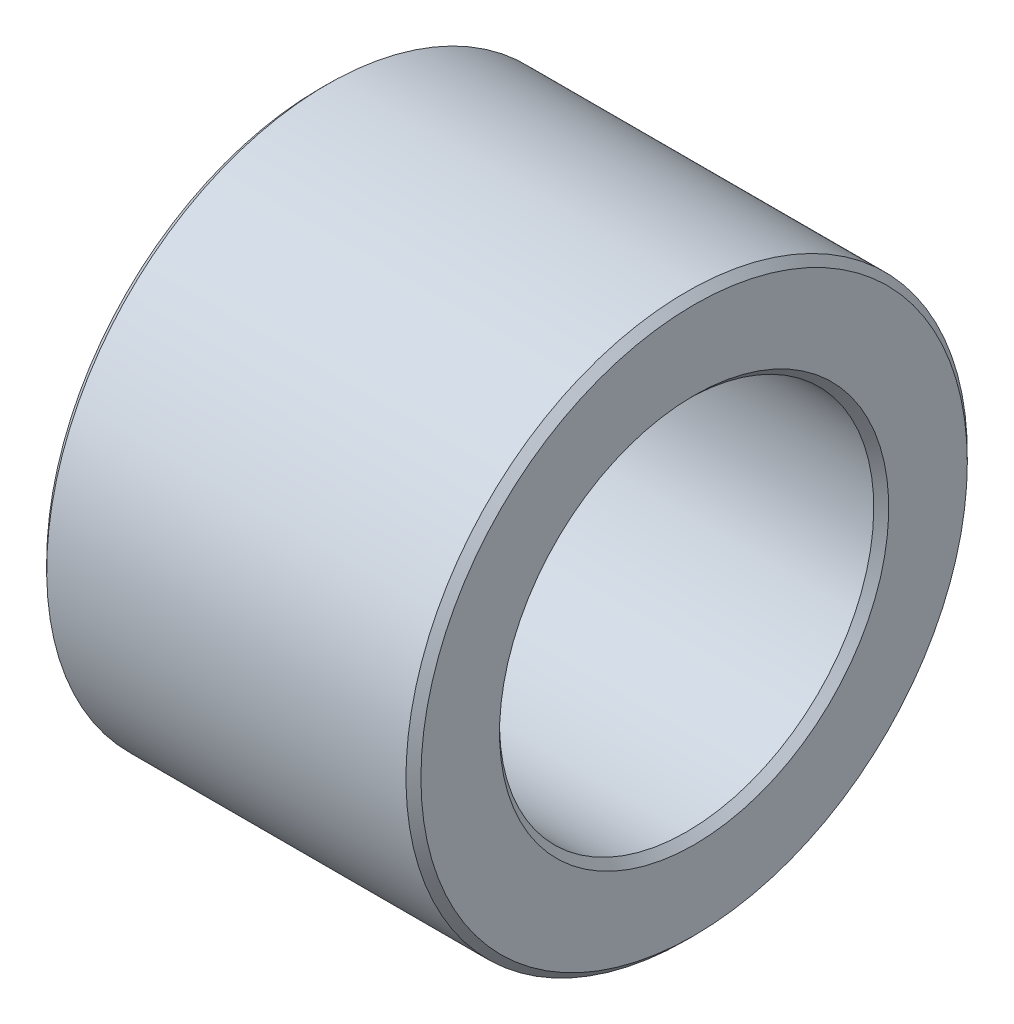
ISO-10303-21;
HEADER;
FILE_DESCRIPTION(('STEP AP214'),'2;1');
FILE_NAME('part.step','',(''),(''),'','','');
FILE_SCHEMA(('AUTOMOTIVE_DESIGN { 1 0 10303 214 1 1 1 1 }'));
ENDSEC;
DATA;
#1=APPLICATION_CONTEXT('core data for automotive mechanical design processes');
#2=APPLICATION_PROTOCOL_DEFINITION('international standard','automotive_design',2000,#1);
#3=PRODUCT_CONTEXT('',#1,'mechanical');
#4=PRODUCT('Part','Part','',(#3));
#5=PRODUCT_RELATED_PRODUCT_CATEGORY('part','',(#4));
#6=PRODUCT_DEFINITION_FORMATION('','',#4);
#7=PRODUCT_DEFINITION_CONTEXT('part definition',#1,'design');
#8=PRODUCT_DEFINITION('design','',#6,#7);
#9=PRODUCT_DEFINITION_SHAPE('','',#8);
#10=(LENGTH_UNIT() NAMED_UNIT(*) SI_UNIT(.MILLI.,.METRE.));
#11=(NAMED_UNIT(*) PLANE_ANGLE_UNIT() SI_UNIT($,.RADIAN.));
#12=(NAMED_UNIT(*) SI_UNIT($,.STERADIAN.) SOLID_ANGLE_UNIT());
#13=UNCERTAINTY_MEASURE_WITH_UNIT(LENGTH_MEASURE(1.E-05),#10,'distance_accuracy_value','');
#14=(GEOMETRIC_REPRESENTATION_CONTEXT(3) GLOBAL_UNCERTAINTY_ASSIGNED_CONTEXT((#13)) GLOBAL_UNIT_ASSIGNED_CONTEXT((#10,
#11,#12)) REPRESENTATION_CONTEXT('',''));
#15=CARTESIAN_POINT('',(0.,0.,0.));
#16=DIRECTION('',(0.,0.,1.));
#17=DIRECTION('',(1.,0.,0.));
#18=AXIS2_PLACEMENT_3D('',#15,#16,#17);
#19=CARTESIAN_POINT('',(0.,-12.5,0.));
#20=DIRECTION('',(-1.,0.,0.));
#21=DIRECTION('',(0.,1.,0.));
#22=AXIS2_PLACEMENT_3D('',#19,#20,#21);
#23=PLANE('',#22);
#24=CARTESIAN_POINT('',(0.,0.,0.));
#25=DIRECTION('',(1.,0.,0.));
#26=DIRECTION('',(0.,-1.,0.));
#27=AXIS2_PLACEMENT_3D('',#24,#25,#26);
#28=CIRCLE('',#27,10.4);
#29=CARTESIAN_POINT('',(0.,-10.4,0.));
#30=VERTEX_POINT('',#29);
#31=EDGE_CURVE('E9',#30,#30,#28,.T.);
#32=ORIENTED_EDGE('',*,*,#31,.T.);
#33=EDGE_LOOP('',(#32));
#34=FACE_BOUND('',#33,.T.);
#35=CARTESIAN_POINT('',(0.,0.,0.));
#36=DIRECTION('',(1.,0.,0.));
#37=DIRECTION('',(0.,-1.,0.));
#38=AXIS2_PLACEMENT_3D('',#35,#36,#37);
#39=CIRCLE('',#38,14.6);
#40=CARTESIAN_POINT('',(0.,-14.6,0.));
#41=VERTEX_POINT('',#40);
#42=EDGE_CURVE('E53',#41,#41,#39,.T.);
#43=ORIENTED_EDGE('',*,*,#42,.F.);
#44=EDGE_LOOP('',(#43));
#45=FACE_BOUND('',#44,.T.);
#46=ADVANCED_FACE('F15',(#34,#45),#23,.T.);
#47=CARTESIAN_POINT('',(0.2,0.,0.));
#48=DIRECTION('',(-1.,0.,0.));
#49=DIRECTION('',(0.,-1.,0.));
#50=AXIS2_PLACEMENT_3D('',#47,#48,#49);
#51=CONICAL_SURFACE('',#50,10.2,0.785398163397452);
#52=CARTESIAN_POINT('',(0.4,0.,0.));
#53=DIRECTION('',(1.,0.,0.));
#54=DIRECTION('',(0.,-1.,0.));
#55=AXIS2_PLACEMENT_3D('',#52,#53,#54);
#56=CIRCLE('',#55,10.);
#57=CARTESIAN_POINT('',(0.4,-10.,0.));
#58=VERTEX_POINT('',#57);
#59=EDGE_CURVE('E22',#58,#58,#56,.T.);
#60=ORIENTED_EDGE('',*,*,#59,.T.);
#61=EDGE_LOOP('',(#60));
#62=FACE_BOUND('',#61,.T.);
#63=ORIENTED_EDGE('',*,*,#31,.F.);
#64=EDGE_LOOP('',(#63));
#65=FACE_BOUND('',#64,.T.);
#66=ADVANCED_FACE('F82',(#62,#65),#51,.F.);
#67=CARTESIAN_POINT('',(10.,0.,0.));
#68=DIRECTION('',(-1.,0.,0.));
#69=DIRECTION('',(0.,-1.,0.));
#70=AXIS2_PLACEMENT_3D('',#67,#68,#69);
#71=CYLINDRICAL_SURFACE('',#70,10.);
#72=CARTESIAN_POINT('',(19.6,0.,0.));
#73=DIRECTION('',(1.,0.,0.));
#74=DIRECTION('',(0.,-1.,0.));
#75=AXIS2_PLACEMENT_3D('',#72,#73,#74);
#76=CIRCLE('',#75,10.);
#77=CARTESIAN_POINT('',(19.6,-10.,0.));
#78=VERTEX_POINT('',#77);
#79=EDGE_CURVE('E58',#78,#78,#76,.T.);
#80=ORIENTED_EDGE('',*,*,#79,.T.);
#81=EDGE_LOOP('',(#80));
#82=FACE_BOUND('',#81,.T.);
#83=ORIENTED_EDGE('',*,*,#59,.F.);
#84=EDGE_LOOP('',(#83));
#85=FACE_BOUND('',#84,.T.);
#86=ADVANCED_FACE('F66',(#82,#85),#71,.F.);
#87=CARTESIAN_POINT('',(19.8,0.,0.));
#88=DIRECTION('',(1.,0.,0.));
#89=DIRECTION('',(0.,-1.,0.));
#90=AXIS2_PLACEMENT_3D('',#87,#88,#89);
#91=CONICAL_SURFACE('',#90,10.2,0.785398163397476);
#92=CARTESIAN_POINT('',(20.,0.,0.));
#93=DIRECTION('',(1.,0.,0.));
#94=DIRECTION('',(0.,-1.,0.));
#95=AXIS2_PLACEMENT_3D('',#92,#93,#94);
#96=CIRCLE('',#95,10.4);
#97=CARTESIAN_POINT('',(20.,-10.4,0.));
#98=VERTEX_POINT('',#97);
#99=EDGE_CURVE('E63',#98,#98,#96,.T.);
#100=ORIENTED_EDGE('',*,*,#99,.T.);
#101=EDGE_LOOP('',(#100));
#102=FACE_BOUND('',#101,.T.);
#103=ORIENTED_EDGE('',*,*,#79,.F.);
#104=EDGE_LOOP('',(#103));
#105=FACE_BOUND('',#104,.T.);
#106=ADVANCED_FACE('F69',(#102,#105),#91,.F.);
#107=CARTESIAN_POINT('',(20.,-12.5,0.));
#108=DIRECTION('',(1.,0.,0.));
#109=DIRECTION('',(0.,-1.,0.));
#110=AXIS2_PLACEMENT_3D('',#107,#108,#109);
#111=PLANE('',#110);
#112=CARTESIAN_POINT('',(20.,0.,0.));
#113=DIRECTION('',(1.,0.,0.));
#114=DIRECTION('',(0.,-1.,0.));
#115=AXIS2_PLACEMENT_3D('',#112,#113,#114);
#116=CIRCLE('',#115,14.6);
#117=CARTESIAN_POINT('',(20.,-14.6,0.));
#118=VERTEX_POINT('',#117);
#119=EDGE_CURVE('E61',#118,#118,#116,.T.);
#120=ORIENTED_EDGE('',*,*,#119,.T.);
#121=EDGE_LOOP('',(#120));
#122=FACE_BOUND('',#121,.T.);
#123=ORIENTED_EDGE('',*,*,#99,.F.);
#124=EDGE_LOOP('',(#123));
#125=FACE_BOUND('',#124,.T.);
#126=ADVANCED_FACE('F71',(#122,#125),#111,.T.);
#127=CARTESIAN_POINT('',(19.8,0.,0.));
#128=DIRECTION('',(-1.,0.,0.));
#129=DIRECTION('',(0.,-1.,0.));
#130=AXIS2_PLACEMENT_3D('',#127,#128,#129);
#131=CONICAL_SURFACE('',#130,14.8,0.785398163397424);
#132=CARTESIAN_POINT('',(19.6,0.,0.));
#133=DIRECTION('',(1.,0.,0.));
#134=DIRECTION('',(0.,-1.,0.));
#135=AXIS2_PLACEMENT_3D('',#132,#133,#134);
#136=CIRCLE('',#135,15.);
#137=CARTESIAN_POINT('',(19.6,-15.,0.));
#138=VERTEX_POINT('',#137);
#139=EDGE_CURVE('E55',#138,#138,#136,.T.);
#140=ORIENTED_EDGE('',*,*,#139,.T.);
#141=EDGE_LOOP('',(#140));
#142=FACE_BOUND('',#141,.T.);
#143=ORIENTED_EDGE('',*,*,#119,.F.);
#144=EDGE_LOOP('',(#143));
#145=FACE_BOUND('',#144,.T.);
#146=ADVANCED_FACE('F79',(#142,#145),#131,.T.);
#147=CARTESIAN_POINT('',(10.,0.,0.));
#148=DIRECTION('',(-1.,0.,0.));
#149=DIRECTION('',(0.,-1.,0.));
#150=AXIS2_PLACEMENT_3D('',#147,#148,#149);
#151=CYLINDRICAL_SURFACE('',#150,15.);
#152=CARTESIAN_POINT('',(0.4,0.,0.));
#153=DIRECTION('',(1.,0.,0.));
#154=DIRECTION('',(0.,-1.,0.));
#155=AXIS2_PLACEMENT_3D('',#152,#153,#154);
#156=CIRCLE('',#155,15.);
#157=CARTESIAN_POINT('',(0.4,-15.,0.));
#158=VERTEX_POINT('',#157);
#159=EDGE_CURVE('E49',#158,#158,#156,.T.);
#160=ORIENTED_EDGE('',*,*,#159,.T.);
#161=EDGE_LOOP('',(#160));
#162=FACE_BOUND('',#161,.T.);
#163=ORIENTED_EDGE('',*,*,#139,.F.);
#164=EDGE_LOOP('',(#163));
#165=FACE_BOUND('',#164,.T.);
#166=ADVANCED_FACE('F50',(#162,#165),#151,.T.);
#167=CARTESIAN_POINT('',(0.2,0.,0.));
#168=DIRECTION('',(1.,0.,0.));
#169=DIRECTION('',(0.,-1.,0.));
#170=AXIS2_PLACEMENT_3D('',#167,#168,#169);
#171=CONICAL_SURFACE('',#170,14.8,0.78539816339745);
#172=ORIENTED_EDGE('',*,*,#42,.T.);
#173=EDGE_LOOP('',(#172));
#174=FACE_BOUND('',#173,.T.);
#175=ORIENTED_EDGE('',*,*,#159,.F.);
#176=EDGE_LOOP('',(#175));
#177=FACE_BOUND('',#176,.T.);
#178=ADVANCED_FACE('F92',(#174,#177),#171,.T.);
#179=CLOSED_SHELL('',(#46,#66,#86,#106,#126,#146,#166,#178));
#180=MANIFOLD_SOLID_BREP('B1',#179);
#181=ADVANCED_BREP_SHAPE_REPRESENTATION('',(#18,#180),#14);
#182=SHAPE_DEFINITION_REPRESENTATION(#9,#181);
ENDSEC;
END-ISO-10303-21;
